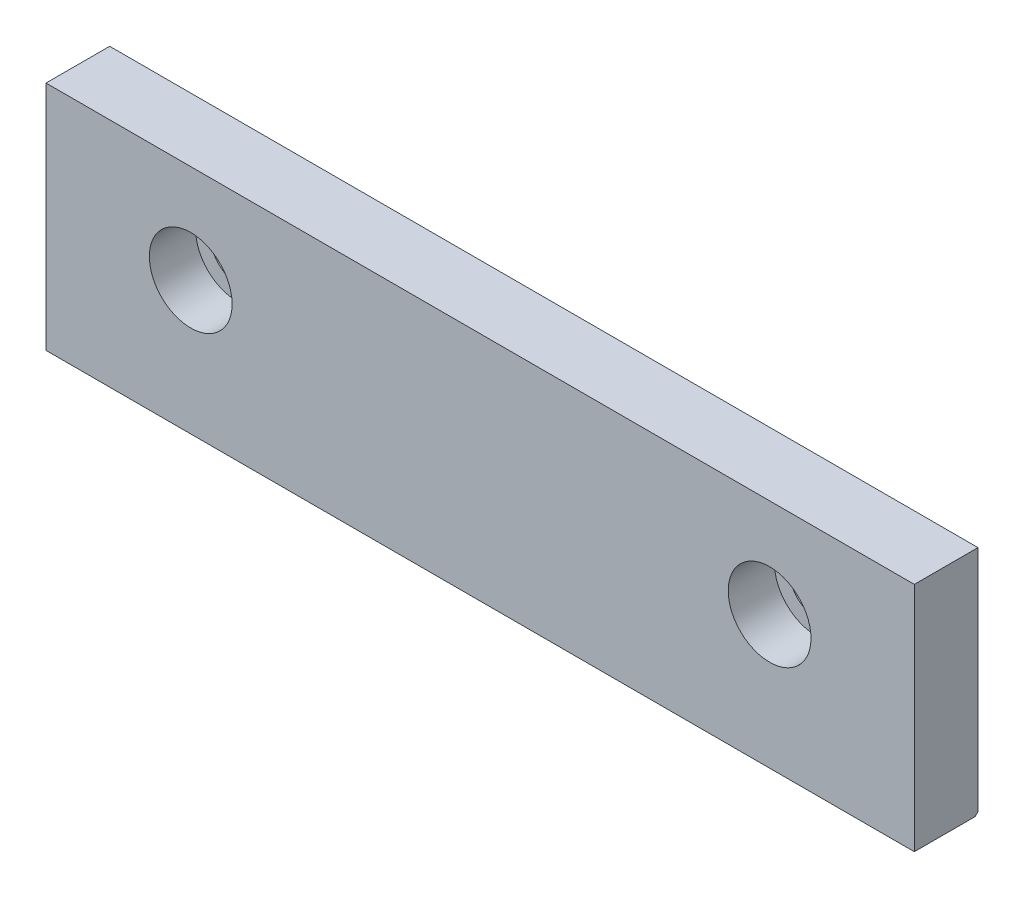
from build123d import *

# Parameters (mm, degrees)
ESQUISSE1_W                                     = 150
ESQUISSE1_H                                     = 40
BASE_EXTRUSION_DEPTH                            = 11
CHAMBRAGE_POUR_VIS_T_TE_CYLINDRIQUE_D           = 9
CHAMBRAGE_POUR_VIS_T_TE_CYLINDRIQUE_CBORE_D     = 14.3
CHAMBRAGE_POUR_VIS_T_TE_CYLINDRIQUE_CBORE_DEPTH = 8
CHANFREIN1_SIZE                                 = 0.5


with BuildPart() as part:
    # Esquisse1 → Base-Extrusion (new body)
    with BuildSketch(Plane.XY):
        Rectangle(ESQUISSE1_W, ESQUISSE1_H)
    extrude(amount=BASE_EXTRUSION_DEPTH)

    # Chambrage pour vis _ t_te cylindrique (through all)
    with Locations(Plane.XY.offset(11)):
        with Locations((-50, 3), (50, 3)):
            CounterBoreHole(CHAMBRAGE_POUR_VIS_T_TE_CYLINDRIQUE_D / 2, CHAMBRAGE_POUR_VIS_T_TE_CYLINDRIQUE_CBORE_D / 2, CHAMBRAGE_POUR_VIS_T_TE_CYLINDRIQUE_CBORE_DEPTH)

    # Chanfrein1
    chanfrein1_edges = [part.edges().sort_by_distance(p)[0] for p in [
        (0, -20, 0),
    ]]
    chamfer(chanfrein1_edges, length=CHANFREIN1_SIZE)


solid = part.part
